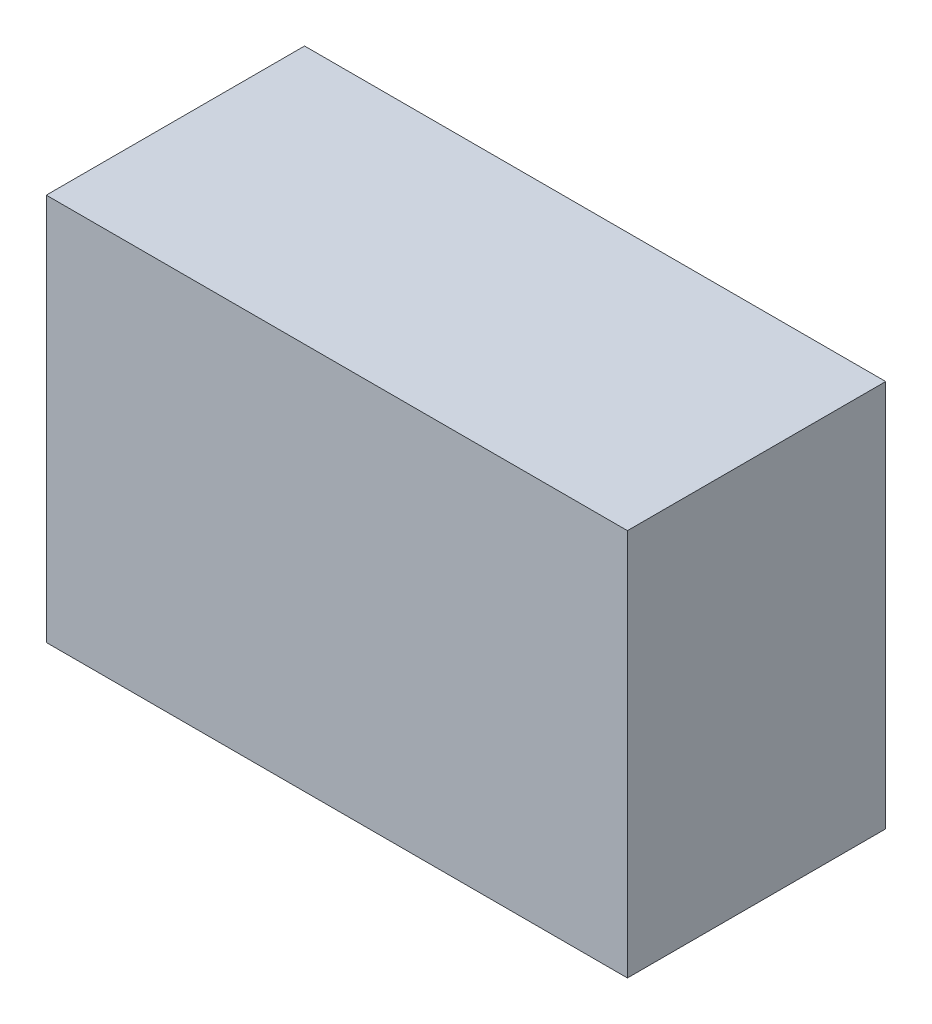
ISO-10303-21;
HEADER;
FILE_DESCRIPTION(('STEP AP214'),'2;1');
FILE_NAME('part.step','',(''),(''),'','','');
FILE_SCHEMA(('AUTOMOTIVE_DESIGN { 1 0 10303 214 1 1 1 1 }'));
ENDSEC;
DATA;
#1=APPLICATION_CONTEXT('core data for automotive mechanical design processes');
#2=APPLICATION_PROTOCOL_DEFINITION('international standard','automotive_design',2000,#1);
#3=PRODUCT_CONTEXT('',#1,'mechanical');
#4=PRODUCT('Part','Part','',(#3));
#5=PRODUCT_RELATED_PRODUCT_CATEGORY('part','',(#4));
#6=PRODUCT_DEFINITION_FORMATION('','',#4);
#7=PRODUCT_DEFINITION_CONTEXT('part definition',#1,'design');
#8=PRODUCT_DEFINITION('design','',#6,#7);
#9=PRODUCT_DEFINITION_SHAPE('','',#8);
#10=(LENGTH_UNIT() NAMED_UNIT(*) SI_UNIT(.MILLI.,.METRE.));
#11=(NAMED_UNIT(*) PLANE_ANGLE_UNIT() SI_UNIT($,.RADIAN.));
#12=(NAMED_UNIT(*) SI_UNIT($,.STERADIAN.) SOLID_ANGLE_UNIT());
#13=UNCERTAINTY_MEASURE_WITH_UNIT(LENGTH_MEASURE(1.E-05),#10,'distance_accuracy_value','');
#14=(GEOMETRIC_REPRESENTATION_CONTEXT(3) GLOBAL_UNCERTAINTY_ASSIGNED_CONTEXT((#13)) GLOBAL_UNIT_ASSIGNED_CONTEXT((#10,
#11,#12)) REPRESENTATION_CONTEXT('',''));
#15=CARTESIAN_POINT('',(0.,0.,0.));
#16=DIRECTION('',(0.,0.,1.));
#17=DIRECTION('',(1.,0.,0.));
#18=AXIS2_PLACEMENT_3D('',#15,#16,#17);
#19=CARTESIAN_POINT('',(135.,0.,20.));
#20=DIRECTION('',(1.,0.,0.));
#21=DIRECTION('',(0.,0.,-1.));
#22=AXIS2_PLACEMENT_3D('',#19,#20,#21);
#23=PLANE('',#22);
#24=DIRECTION('',(0.,-1.,0.));
#25=VECTOR('',#24,1.);
#26=CARTESIAN_POINT('',(135.,0.,0.));
#27=LINE('',#26,#25);
#28=CARTESIAN_POINT('',(135.,0.,0.));
#29=VERTEX_POINT('',#28);
#30=CARTESIAN_POINT('',(135.,-30.,0.));
#31=VERTEX_POINT('',#30);
#32=EDGE_CURVE('E70',#29,#31,#27,.T.);
#33=ORIENTED_EDGE('',*,*,#32,.T.);
#34=DIRECTION('',(0.,0.,-1.));
#35=VECTOR('',#34,1.);
#36=CARTESIAN_POINT('',(135.,-30.,20.));
#37=LINE('',#36,#35);
#38=CARTESIAN_POINT('',(135.,-30.,20.));
#39=VERTEX_POINT('',#38);
#40=EDGE_CURVE('E11',#39,#31,#37,.T.);
#41=ORIENTED_EDGE('',*,*,#40,.F.);
#42=DIRECTION('',(0.,-1.,0.));
#43=VECTOR('',#42,1.);
#44=CARTESIAN_POINT('',(135.,0.,20.));
#45=LINE('',#44,#43);
#46=CARTESIAN_POINT('',(135.,0.,20.));
#47=VERTEX_POINT('',#46);
#48=EDGE_CURVE('E88',#47,#39,#45,.T.);
#49=ORIENTED_EDGE('',*,*,#48,.F.);
#50=DIRECTION('',(0.,0.,-1.));
#51=VECTOR('',#50,1.);
#52=CARTESIAN_POINT('',(135.,0.,20.));
#53=LINE('',#52,#51);
#54=EDGE_CURVE('E82',#47,#29,#53,.T.);
#55=ORIENTED_EDGE('',*,*,#54,.T.);
#56=EDGE_LOOP('',(#33,#41,#49,#55));
#57=FACE_BOUND('',#56,.T.);
#58=ADVANCED_FACE('F26',(#57),#23,.F.);
#59=CARTESIAN_POINT('',(135.,-30.,20.));
#60=DIRECTION('',(0.,1.,0.));
#61=DIRECTION('',(0.,0.,1.));
#62=AXIS2_PLACEMENT_3D('',#59,#60,#61);
#63=PLANE('',#62);
#64=DIRECTION('',(1.,0.,0.));
#65=VECTOR('',#64,1.);
#66=CARTESIAN_POINT('',(135.,-30.,0.));
#67=LINE('',#66,#65);
#68=CARTESIAN_POINT('',(180.,-30.,0.));
#69=VERTEX_POINT('',#68);
#70=EDGE_CURVE('E66',#31,#69,#67,.T.);
#71=ORIENTED_EDGE('',*,*,#70,.T.);
#72=DIRECTION('',(0.,0.,-1.));
#73=VECTOR('',#72,1.);
#74=CARTESIAN_POINT('',(180.,-30.,20.));
#75=LINE('',#74,#73);
#76=CARTESIAN_POINT('',(180.,-30.,20.));
#77=VERTEX_POINT('',#76);
#78=EDGE_CURVE('E33',#77,#69,#75,.T.);
#79=ORIENTED_EDGE('',*,*,#78,.F.);
#80=DIRECTION('',(1.,0.,0.));
#81=VECTOR('',#80,1.);
#82=CARTESIAN_POINT('',(135.,-30.,20.));
#83=LINE('',#82,#81);
#84=EDGE_CURVE('E78',#39,#77,#83,.T.);
#85=ORIENTED_EDGE('',*,*,#84,.F.);
#86=ORIENTED_EDGE('',*,*,#40,.T.);
#87=EDGE_LOOP('',(#71,#79,#85,#86));
#88=FACE_BOUND('',#87,.T.);
#89=ADVANCED_FACE('F77',(#88),#63,.F.);
#90=CARTESIAN_POINT('',(180.,0.,20.));
#91=DIRECTION('',(-1.,0.,0.));
#92=DIRECTION('',(0.,0.,1.));
#93=AXIS2_PLACEMENT_3D('',#90,#91,#92);
#94=PLANE('',#93);
#95=DIRECTION('',(0.,1.,0.));
#96=VECTOR('',#95,1.);
#97=CARTESIAN_POINT('',(180.,0.,0.));
#98=LINE('',#97,#96);
#99=CARTESIAN_POINT('',(180.,0.,0.));
#100=VERTEX_POINT('',#99);
#101=EDGE_CURVE('E71',#69,#100,#98,.T.);
#102=ORIENTED_EDGE('',*,*,#101,.T.);
#103=DIRECTION('',(0.,0.,-1.));
#104=VECTOR('',#103,1.);
#105=CARTESIAN_POINT('',(180.,0.,20.));
#106=LINE('',#105,#104);
#107=CARTESIAN_POINT('',(180.,0.,20.));
#108=VERTEX_POINT('',#107);
#109=EDGE_CURVE('E94',#108,#100,#106,.T.);
#110=ORIENTED_EDGE('',*,*,#109,.F.);
#111=DIRECTION('',(0.,1.,0.));
#112=VECTOR('',#111,1.);
#113=CARTESIAN_POINT('',(180.,0.,20.));
#114=LINE('',#113,#112);
#115=EDGE_CURVE('E45',#77,#108,#114,.T.);
#116=ORIENTED_EDGE('',*,*,#115,.F.);
#117=ORIENTED_EDGE('',*,*,#78,.T.);
#118=EDGE_LOOP('',(#102,#110,#116,#117));
#119=FACE_BOUND('',#118,.T.);
#120=ADVANCED_FACE('F97',(#119),#94,.F.);
#121=CARTESIAN_POINT('',(135.,0.,20.));
#122=DIRECTION('',(0.,-1.,0.));
#123=DIRECTION('',(0.,0.,-1.));
#124=AXIS2_PLACEMENT_3D('',#121,#122,#123);
#125=PLANE('',#124);
#126=DIRECTION('',(-1.,0.,0.));
#127=VECTOR('',#126,1.);
#128=CARTESIAN_POINT('',(135.,0.,0.));
#129=LINE('',#128,#127);
#130=EDGE_CURVE('E86',#100,#29,#129,.T.);
#131=ORIENTED_EDGE('',*,*,#130,.T.);
#132=ORIENTED_EDGE('',*,*,#54,.F.);
#133=DIRECTION('',(-1.,0.,0.));
#134=VECTOR('',#133,1.);
#135=CARTESIAN_POINT('',(135.,0.,20.));
#136=LINE('',#135,#134);
#137=EDGE_CURVE('E40',#108,#47,#136,.T.);
#138=ORIENTED_EDGE('',*,*,#137,.F.);
#139=ORIENTED_EDGE('',*,*,#109,.T.);
#140=EDGE_LOOP('',(#131,#132,#138,#139));
#141=FACE_BOUND('',#140,.T.);
#142=ADVANCED_FACE('F99',(#141),#125,.F.);
#143=CARTESIAN_POINT('',(135.,-30.,20.));
#144=DIRECTION('',(0.,0.,1.));
#145=DIRECTION('',(1.,0.,0.));
#146=AXIS2_PLACEMENT_3D('',#143,#144,#145);
#147=PLANE('',#146);
#148=ORIENTED_EDGE('',*,*,#48,.T.);
#149=ORIENTED_EDGE('',*,*,#84,.T.);
#150=ORIENTED_EDGE('',*,*,#115,.T.);
#151=ORIENTED_EDGE('',*,*,#137,.T.);
#152=EDGE_LOOP('',(#148,#149,#150,#151));
#153=FACE_BOUND('',#152,.T.);
#154=ADVANCED_FACE('F100',(#153),#147,.T.);
#155=CARTESIAN_POINT('',(135.,-30.,0.));
#156=DIRECTION('',(0.,0.,1.));
#157=DIRECTION('',(1.,0.,0.));
#158=AXIS2_PLACEMENT_3D('',#155,#156,#157);
#159=PLANE('',#158);
#160=ORIENTED_EDGE('',*,*,#32,.F.);
#161=ORIENTED_EDGE('',*,*,#130,.F.);
#162=ORIENTED_EDGE('',*,*,#101,.F.);
#163=ORIENTED_EDGE('',*,*,#70,.F.);
#164=EDGE_LOOP('',(#160,#161,#162,#163));
#165=FACE_BOUND('',#164,.T.);
#166=ADVANCED_FACE('F67',(#165),#159,.F.);
#167=CLOSED_SHELL('',(#58,#89,#120,#142,#154,#166));
#168=MANIFOLD_SOLID_BREP('B2',#167);
#169=ADVANCED_BREP_SHAPE_REPRESENTATION('',(#18,#168),#14);
#170=SHAPE_DEFINITION_REPRESENTATION(#9,#169);
ENDSEC;
END-ISO-10303-21;
